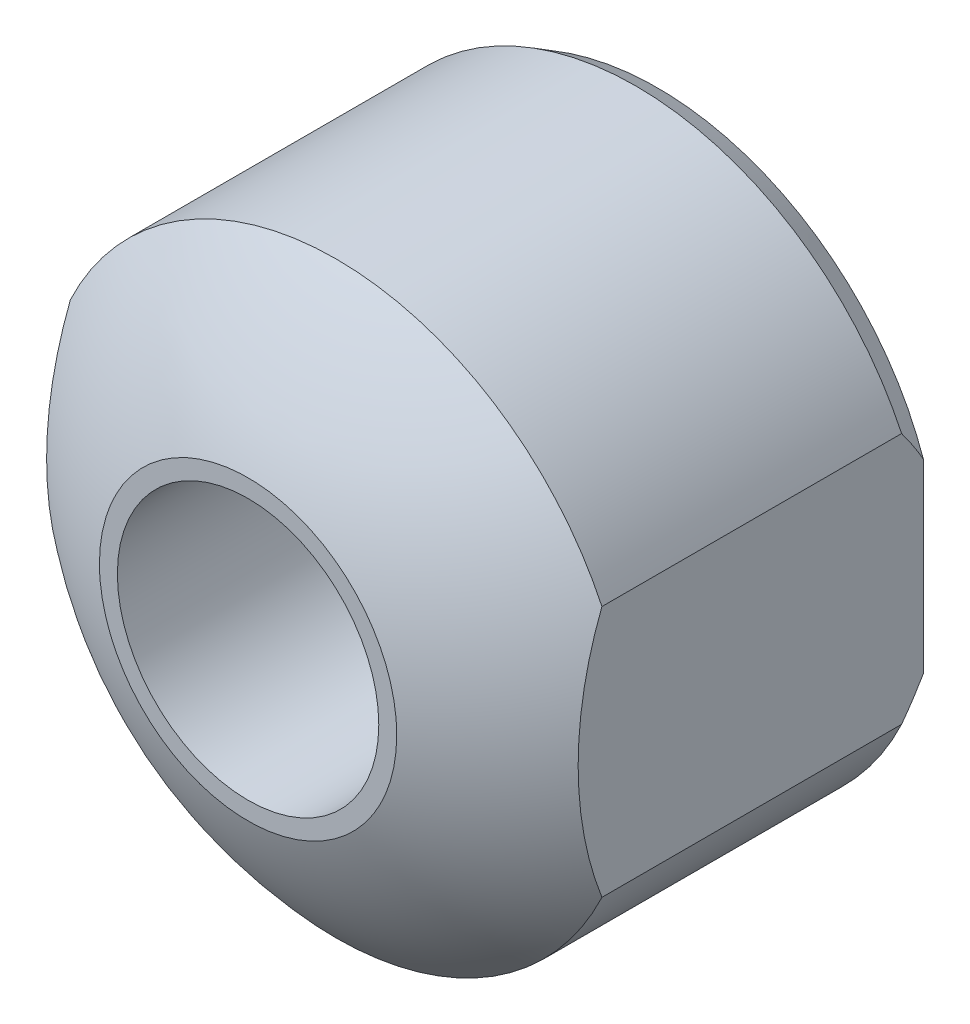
ISO-10303-21;
HEADER;
FILE_DESCRIPTION(('STEP AP214'),'2;1');
FILE_NAME('part.step','',(''),(''),'','','');
FILE_SCHEMA(('AUTOMOTIVE_DESIGN { 1 0 10303 214 1 1 1 1 }'));
ENDSEC;
DATA;
#1=APPLICATION_CONTEXT('core data for automotive mechanical design processes');
#2=APPLICATION_PROTOCOL_DEFINITION('international standard','automotive_design',2000,#1);
#3=PRODUCT_CONTEXT('',#1,'mechanical');
#4=PRODUCT('Part','Part','',(#3));
#5=PRODUCT_RELATED_PRODUCT_CATEGORY('part','',(#4));
#6=PRODUCT_DEFINITION_FORMATION('','',#4);
#7=PRODUCT_DEFINITION_CONTEXT('part definition',#1,'design');
#8=PRODUCT_DEFINITION('design','',#6,#7);
#9=PRODUCT_DEFINITION_SHAPE('','',#8);
#10=(LENGTH_UNIT() NAMED_UNIT(*) SI_UNIT(.MILLI.,.METRE.));
#11=(NAMED_UNIT(*) PLANE_ANGLE_UNIT() SI_UNIT($,.RADIAN.));
#12=(NAMED_UNIT(*) SI_UNIT($,.STERADIAN.) SOLID_ANGLE_UNIT());
#13=UNCERTAINTY_MEASURE_WITH_UNIT(LENGTH_MEASURE(1.E-05),#10,'distance_accuracy_value','');
#14=(GEOMETRIC_REPRESENTATION_CONTEXT(3) GLOBAL_UNCERTAINTY_ASSIGNED_CONTEXT((#13)) GLOBAL_UNIT_ASSIGNED_CONTEXT((#10,
#11,#12)) REPRESENTATION_CONTEXT('',''));
#15=CARTESIAN_POINT('',(0.,0.,0.));
#16=DIRECTION('',(0.,0.,1.));
#17=DIRECTION('',(1.,0.,0.));
#18=AXIS2_PLACEMENT_3D('',#15,#16,#17);
#19=CARTESIAN_POINT('',(0.,-3.91353616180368E-12,0.4999999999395));
#20=DIRECTION('',(0.,-7.82667624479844E-12,1.));
#21=DIRECTION('',(1.,0.,0.));
#22=AXIS2_PLACEMENT_3D('',#19,#20,#21);
#23=CONICAL_SURFACE('',#22,6.75000000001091,0.523598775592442);
#24=CARTESIAN_POINT('',(-6.09999999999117,2.13042695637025,-4.93771690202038E-11));
#25=CARTESIAN_POINT('',(-6.09999999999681,2.19631009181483,0.0376288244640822));
#26=CARTESIAN_POINT('',(-6.09999999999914,2.26151952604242,0.0764214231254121));
#27=CARTESIAN_POINT('',(-6.10000000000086,2.39058711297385,0.156070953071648));
#28=CARTESIAN_POINT('',(-6.10000000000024,2.4544464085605,0.196926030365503));
#29=CARTESIAN_POINT('',(-6.09999999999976,2.58092106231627,0.280501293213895));
#30=CARTESIAN_POINT('',(-6.09999999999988,2.6435365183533,0.323221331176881));
#31=CARTESIAN_POINT('',(-6.10000000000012,2.76764477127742,0.410378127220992));
#32=CARTESIAN_POINT('',(-6.10000000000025,2.82913652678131,0.454816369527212));
#33=CARTESIAN_POINT('',(-6.1,2.89006920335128,0.499999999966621));
#34=B_SPLINE_CURVE_WITH_KNOTS('',3,(#24,#25,#26,#27,#28,#29,#30,#31,#32,#33),.UNSPECIFIED.,.F.,
.F.,(4,2,2,2,4),(0.,0.227591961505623,0.454982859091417,0.682355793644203,0.909929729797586),.UNSPECIFIED.);
#35=CARTESIAN_POINT('',(-6.1,2.13042695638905,-4.19282664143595E-11));
#36=VERTEX_POINT('',#35);
#37=CARTESIAN_POINT('',(-6.1,2.89006920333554,0.499999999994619));
#38=VERTEX_POINT('',#37);
#39=EDGE_CURVE('E18',#36,#38,#34,.T.);
#40=ORIENTED_EDGE('',*,*,#39,.T.);
#41=CARTESIAN_POINT('',(0.,-3.91353616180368E-12,0.5));
#42=DIRECTION('',(0.,7.82667624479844E-12,-1.));
#43=DIRECTION('',(-1.,0.,0.));
#44=AXIS2_PLACEMENT_3D('',#41,#42,#43);
#45=CIRCLE('',#44,6.75);
#46=CARTESIAN_POINT('',(6.1,2.89006920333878,0.49999999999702));
#47=VERTEX_POINT('',#46);
#48=EDGE_CURVE('E103',#47,#38,#45,.F.);
#49=ORIENTED_EDGE('',*,*,#48,.F.);
#50=CARTESIAN_POINT('',(6.1,2.89006920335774,0.499999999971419));
#51=CARTESIAN_POINT('',(6.1,2.82913652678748,0.454816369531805));
#52=CARTESIAN_POINT('',(6.1,2.76764477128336,0.410378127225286));
#53=CARTESIAN_POINT('',(6.1,2.64353651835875,0.323221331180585));
#54=CARTESIAN_POINT('',(6.1,2.58092106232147,0.280501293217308));
#55=CARTESIAN_POINT('',(6.1,2.45444640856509,0.196926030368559));
#56=CARTESIAN_POINT('',(6.1,2.39058711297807,0.156070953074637));
#57=CARTESIAN_POINT('',(6.1,2.26151952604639,0.0764214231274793));
#58=CARTESIAN_POINT('',(6.1,2.19631009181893,0.037628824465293));
#59=CARTESIAN_POINT('',(6.1,2.130426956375,-4.99288110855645E-11));
#60=B_SPLINE_CURVE_WITH_KNOTS('',3,(#50,#51,#52,#53,#54,#55,#56,#57,#58,#59),.UNSPECIFIED.,.F.,
.F.,(4,2,2,2,4),(0.,0.227573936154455,0.454946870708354,0.682337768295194,0.909929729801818),.UNSPECIFIED.);
#61=CARTESIAN_POINT('',(6.1,2.1304269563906,-4.10262102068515E-11));
#62=VERTEX_POINT('',#61);
#63=EDGE_CURVE('E86',#47,#62,#60,.T.);
#64=ORIENTED_EDGE('',*,*,#63,.T.);
#65=CARTESIAN_POINT('',(0.,0.,-4.86520546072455E-11));
#66=DIRECTION('',(0.,-7.82667624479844E-12,1.));
#67=DIRECTION('',(1.,0.,0.));
#68=AXIS2_PLACEMENT_3D('',#65,#66,#67);
#69=CIRCLE('',#68,6.46132486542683);
#70=EDGE_CURVE('E84',#36,#62,#69,.F.);
#71=ORIENTED_EDGE('',*,*,#70,.F.);
#72=EDGE_LOOP('',(#40,#49,#64,#71));
#73=FACE_BOUND('',#72,.T.);
#74=ADVANCED_FACE('F14',(#73),#23,.T.);
#75=CARTESIAN_POINT('',(-3.23066243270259,0.,0.));
#76=DIRECTION('',(0.,7.82667624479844E-12,-1.));
#77=DIRECTION('',(-1.,0.,0.));
#78=AXIS2_PLACEMENT_3D('',#75,#76,#77);
#79=PLANE('',#78);
#80=CARTESIAN_POINT('',(0.,0.,6.50486609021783E-11));
#81=DIRECTION('',(0.,7.82667624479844E-12,-1.));
#82=DIRECTION('',(-1.,0.,0.));
#83=AXIS2_PLACEMENT_3D('',#80,#81,#82);
#84=CIRCLE('',#83,2.99999999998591);
#85=CARTESIAN_POINT('',(-2.99999999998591,0.,6.50486609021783E-11));
#86=VERTEX_POINT('',#85);
#87=EDGE_CURVE('E89',#86,#86,#84,.F.);
#88=ORIENTED_EDGE('',*,*,#87,.T.);
#89=EDGE_LOOP('',(#88));
#90=FACE_BOUND('',#89,.T.);
#91=DIRECTION('',(0.,1.,7.82667624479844E-12));
#92=VECTOR('',#91,1.);
#93=CARTESIAN_POINT('',(-6.1,6.75,5.28327381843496E-11));
#94=LINE('',#93,#92);
#95=CARTESIAN_POINT('',(-6.1,-2.13042695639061,-7.43745343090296E-11));
#96=VERTEX_POINT('',#95);
#97=EDGE_CURVE('E79',#96,#36,#94,.T.);
#98=ORIENTED_EDGE('',*,*,#97,.T.);
#99=ORIENTED_EDGE('',*,*,#70,.T.);
#100=DIRECTION('',(0.,-1.,-7.82667624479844E-12));
#101=VECTOR('',#100,1.);
#102=CARTESIAN_POINT('',(6.1,6.75,5.28327381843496E-11));
#103=LINE('',#102,#101);
#104=CARTESIAN_POINT('',(6.1,-2.130426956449,-4.10262102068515E-11));
#105=VERTEX_POINT('',#104);
#106=EDGE_CURVE('E108',#62,#105,#103,.T.);
#107=ORIENTED_EDGE('',*,*,#106,.T.);
#108=CARTESIAN_POINT('',(0.,0.,-4.86520546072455E-11));
#109=DIRECTION('',(0.,-7.82667624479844E-12,1.));
#110=DIRECTION('',(1.,0.,0.));
#111=AXIS2_PLACEMENT_3D('',#108,#109,#110);
#112=CIRCLE('',#111,6.46132486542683);
#113=EDGE_CURVE('E92',#96,#105,#112,.T.);
#114=ORIENTED_EDGE('',*,*,#113,.F.);
#115=EDGE_LOOP('',(#98,#99,#107,#114));
#116=FACE_BOUND('',#115,.T.);
#117=ADVANCED_FACE('F90',(#90,#116),#79,.T.);
#118=CARTESIAN_POINT('',(0.,-3.91353616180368E-12,0.4999999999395));
#119=DIRECTION('',(0.,-7.82667624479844E-12,1.));
#120=DIRECTION('',(1.,0.,0.));
#121=AXIS2_PLACEMENT_3D('',#118,#119,#120);
#122=CONICAL_SURFACE('',#121,6.75000000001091,0.523598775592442);
#123=CARTESIAN_POINT('',(-6.1,-2.89006920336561,0.499999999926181));
#124=CARTESIAN_POINT('',(-6.1,-2.82913652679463,0.454816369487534));
#125=CARTESIAN_POINT('',(-6.1,-2.76764477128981,0.410378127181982));
#126=CARTESIAN_POINT('',(-6.1,-2.64353651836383,0.323221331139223));
#127=CARTESIAN_POINT('',(-6.1,-2.58092106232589,0.280501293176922));
#128=CARTESIAN_POINT('',(-6.1,-2.45444640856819,0.196926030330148));
#129=CARTESIAN_POINT('',(-6.1,-2.39058711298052,0.156070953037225));
#130=CARTESIAN_POINT('',(-6.1,-2.2615195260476,0.076421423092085));
#131=CARTESIAN_POINT('',(-6.1,-2.19631009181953,0.0376288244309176));
#132=CARTESIAN_POINT('',(-6.1,-2.13042695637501,-8.32771351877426E-11));
#133=B_SPLINE_CURVE_WITH_KNOTS('',3,(#123,#124,#125,#126,#127,#128,#129,#130,#131,#132),
.UNSPECIFIED.,.F.,.F.,(4,2,2,2,4),(0.,0.227573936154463,0.454946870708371,0.68233776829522,
0.909929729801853),.UNSPECIFIED.);
#134=CARTESIAN_POINT('',(-6.1,-2.89006920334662,0.499999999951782));
#135=VERTEX_POINT('',#134);
#136=EDGE_CURVE('E95',#135,#96,#133,.T.);
#137=ORIENTED_EDGE('',*,*,#136,.T.);
#138=ORIENTED_EDGE('',*,*,#113,.T.);
#139=CARTESIAN_POINT('',(6.09999999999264,-2.1304269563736,-8.1375878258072E-11));
#140=CARTESIAN_POINT('',(6.09999999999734,-2.19631009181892,0.0376288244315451));
#141=CARTESIAN_POINT('',(6.09999999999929,-2.26151952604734,0.0764214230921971));
#142=CARTESIAN_POINT('',(6.10000000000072,-2.39058711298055,0.156070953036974));
#143=CARTESIAN_POINT('',(6.1000000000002,-2.45444640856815,0.196926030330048));
#144=CARTESIAN_POINT('',(6.0999999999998,-2.58092106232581,0.280501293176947));
#145=CARTESIAN_POINT('',(6.0999999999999,-2.64353651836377,0.323221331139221));
#146=CARTESIAN_POINT('',(6.1000000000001,-2.7676447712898,0.410378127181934));
#147=CARTESIAN_POINT('',(6.1000000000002,-2.82913652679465,0.454816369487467));
#148=CARTESIAN_POINT('',(6.1,-2.89006920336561,0.499999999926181));
#149=B_SPLINE_CURVE_WITH_KNOTS('',3,(#139,#140,#141,#142,#143,#144,#145,#146,#147,#148),
.UNSPECIFIED.,.F.,.F.,(4,2,2,2,4),(0.,0.227591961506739,0.454982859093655,0.682355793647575,
0.909929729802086),.UNSPECIFIED.);
#150=CARTESIAN_POINT('',(6.1,-2.89006920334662,0.499999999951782));
#151=VERTEX_POINT('',#150);
#152=EDGE_CURVE('E107',#105,#151,#149,.T.);
#153=ORIENTED_EDGE('',*,*,#152,.T.);
#154=CARTESIAN_POINT('',(0.,-3.91353616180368E-12,0.5));
#155=DIRECTION('',(0.,7.82667624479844E-12,-1.));
#156=DIRECTION('',(-1.,0.,0.));
#157=AXIS2_PLACEMENT_3D('',#154,#155,#156);
#158=CIRCLE('',#157,6.75);
#159=EDGE_CURVE('E110',#135,#151,#158,.F.);
#160=ORIENTED_EDGE('',*,*,#159,.F.);
#161=EDGE_LOOP('',(#137,#138,#153,#160));
#162=FACE_BOUND('',#161,.T.);
#163=ADVANCED_FACE('F147',(#162),#122,.T.);
#164=CARTESIAN_POINT('',(-1.7058722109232,-7.35730920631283E-11,9.4));
#165=DIRECTION('',(0.,-7.82667624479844E-12,1.));
#166=DIRECTION('',(1.,0.,0.));
#167=AXIS2_PLACEMENT_3D('',#164,#165,#166);
#168=PLANE('',#167);
#169=CARTESIAN_POINT('',(3.41174442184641,-7.35730920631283E-11,9.4));
#170=CARTESIAN_POINT('',(3.411753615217,-0.0959583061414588,9.39999999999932));
#171=CARTESIAN_POINT('',(3.40769608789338,-0.191912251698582,9.39999999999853));
#172=CARTESIAN_POINT('',(3.39151873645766,-0.38313365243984,9.39999999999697));
#173=CARTESIAN_POINT('',(3.37939929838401,-0.478401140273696,9.39999999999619));
#174=CARTESIAN_POINT('',(3.34718058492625,-0.667514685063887,9.39999999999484));
#175=CARTESIAN_POINT('',(3.32708692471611,-0.761361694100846,9.39999999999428));
#176=CARTESIAN_POINT('',(3.2790827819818,-0.947006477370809,9.39999999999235));
#177=CARTESIAN_POINT('',(3.25117239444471,-1.03880427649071,9.399999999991));
#178=CARTESIAN_POINT('',(3.15594259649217,-1.31023513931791,9.39999999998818));
#179=CARTESIAN_POINT('',(3.07711083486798,-1.48598574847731,9.39999999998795));
#180=CARTESIAN_POINT('',(2.89111439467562,-1.82162480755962,9.39999999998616));
#181=CARTESIAN_POINT('',(2.78395528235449,-1.98151636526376,9.3999999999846));
#182=CARTESIAN_POINT('',(2.54430388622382,-2.28107137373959,9.39999999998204));
#183=CARTESIAN_POINT('',(2.41181104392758,-2.42073437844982,9.39999999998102));
#184=CARTESIAN_POINT('',(2.12524080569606,-2.6758488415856,9.39999999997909));
#185=CARTESIAN_POINT('',(1.97116012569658,-2.79129660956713,9.39999999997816));
#186=CARTESIAN_POINT('',(1.6458090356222,-2.99468075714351,9.39999999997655));
#187=CARTESIAN_POINT('',(1.47453938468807,-3.08261835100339,9.39999999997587));
#188=CARTESIAN_POINT('',(1.11967881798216,-3.22848550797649,9.39999999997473));
#189=CARTESIAN_POINT('',(0.936088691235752,-3.28641699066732,9.39999999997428));
#190=CARTESIAN_POINT('',(0.561784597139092,-3.37063758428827,9.39999999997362));
#191=CARTESIAN_POINT('',(0.371070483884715,-3.39692604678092,9.39999999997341));
#192=CARTESIAN_POINT('',(-0.0120687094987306,-3.41711223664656,9.39999999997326));
#193=CARTESIAN_POINT('',(-0.204493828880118,-3.41100921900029,9.39999999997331));
#194=CARTESIAN_POINT('',(-0.585586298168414,-3.36658426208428,9.39999999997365));
#195=CARTESIAN_POINT('',(-0.774253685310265,-3.32826264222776,9.39999999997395));
#196=CARTESIAN_POINT('',(-1.14247634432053,-3.22048884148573,9.3999999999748));
#197=CARTESIAN_POINT('',(-1.32203164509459,-3.15103675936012,9.39999999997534));
#198=CARTESIAN_POINT('',(-1.66693827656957,-2.98297162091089,9.39999999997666));
#199=CARTESIAN_POINT('',(-1.83228923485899,-2.88435780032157,9.39999999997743));
#200=CARTESIAN_POINT('',(-2.1440801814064,-2.66077396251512,9.39999999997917));
#201=CARTESIAN_POINT('',(-2.29052110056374,-2.53580524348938,9.39999999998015));
#202=CARTESIAN_POINT('',(-2.56032639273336,-2.26307781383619,9.39999999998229));
#203=CARTESIAN_POINT('',(-2.68369386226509,-2.11532216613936,9.39999999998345));
#204=CARTESIAN_POINT('',(-2.90391130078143,-1.80113906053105,9.3999999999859));
#205=CARTESIAN_POINT('',(-3.00075282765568,-1.63470568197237,9.3999999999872));
#206=CARTESIAN_POINT('',(-3.16516464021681,-1.28787226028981,9.39999999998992));
#207=CARTESIAN_POINT('',(-3.23271710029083,-1.10746379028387,9.39999999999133));
#208=CARTESIAN_POINT('',(-3.3364714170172,-0.738007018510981,9.39999999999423));
#209=CARTESIAN_POINT('',(-3.37272115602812,-0.548972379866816,9.39999999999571));
#210=CARTESIAN_POINT('',(-3.39915729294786,-0.298901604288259,9.39999999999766));
#211=CARTESIAN_POINT('',(-3.40387996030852,-0.239166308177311,9.39999999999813));
#212=CARTESIAN_POINT('',(-3.41016921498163,-0.119628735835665,9.39999999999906));
#213=CARTESIAN_POINT('',(-3.41174100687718,-0.059826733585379,9.39999999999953));
#214=CARTESIAN_POINT('',(-3.41174442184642,-7.35730920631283E-11,9.4));
#215=B_SPLINE_CURVE_WITH_KNOTS('',3,(#169,#170,#171,#172,#173,#174,#175,#176,#177,#178,#179,
#180,#181,#182,#183,#184,#185,#186,#187,#188,#189,#190,#191,#192,#193,#194,#195,#196,#197,#198,
#199,#200,#201,#202,#203,#204,#205,#206,#207,#208,#209,#210,#211,#212,#213,#214),.UNSPECIFIED.,
.F.,.F.,(4,2,2,2,2,2,2,2,2,2,2,2,2,2,2,2,2,2,2,2,2,2,4),(0.,0.287781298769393,0.575548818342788,
0.863114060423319,1.15067580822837,1.7255586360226,2.30032858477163,2.87511120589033,
3.44998136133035,4.02482613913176,4.59963413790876,5.17445391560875,5.74928691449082,
6.32411421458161,6.8989396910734,7.47378023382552,8.04859246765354,8.62332750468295,
9.19824524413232,9.77351239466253,10.3478980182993,10.5276052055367,10.7070153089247),.UNSPECIFIED.);
#216=CARTESIAN_POINT('',(3.41174442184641,-7.35730920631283E-11,9.4));
#217=VERTEX_POINT('',#216);
#218=CARTESIAN_POINT('',(-3.41174442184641,-7.35730920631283E-11,9.4));
#219=VERTEX_POINT('',#218);
#220=EDGE_CURVE('E113',#217,#219,#215,.T.);
#221=ORIENTED_EDGE('',*,*,#220,.F.);
#222=CARTESIAN_POINT('',(-3.41174442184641,-7.35730920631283E-11,9.4));
#223=CARTESIAN_POINT('',(-3.41175361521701,0.0959583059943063,9.40000000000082));
#224=CARTESIAN_POINT('',(-3.40769608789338,0.191912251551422,9.40000000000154));
#225=CARTESIAN_POINT('',(-3.39151873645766,0.383133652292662,9.40000000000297));
#226=CARTESIAN_POINT('',(-3.37939929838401,0.478401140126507,9.40000000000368));
#227=CARTESIAN_POINT('',(-3.34718058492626,0.667514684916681,9.40000000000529));
#228=CARTESIAN_POINT('',(-3.32708692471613,0.761361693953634,9.40000000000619));
#229=CARTESIAN_POINT('',(-3.27908278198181,0.947006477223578,9.40000000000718));
#230=CARTESIAN_POINT('',(-3.25117239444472,1.03880427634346,9.40000000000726));
#231=CARTESIAN_POINT('',(-3.15594259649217,1.31023513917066,9.40000000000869));
#232=CARTESIAN_POINT('',(-3.07711083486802,1.48598574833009,9.40000000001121));
#233=CARTESIAN_POINT('',(-2.89111439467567,1.82162480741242,9.40000000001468));
#234=CARTESIAN_POINT('',(-2.78395528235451,1.98151636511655,9.40000000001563));
#235=CARTESIAN_POINT('',(-2.54430388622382,2.28107137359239,9.40000000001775));
#236=CARTESIAN_POINT('',(-2.4118110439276,2.42073437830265,9.40000000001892));
#237=CARTESIAN_POINT('',(-2.12524080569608,2.67584884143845,9.40000000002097));
#238=CARTESIAN_POINT('',(-1.97116012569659,2.79129660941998,9.40000000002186));
#239=CARTESIAN_POINT('',(-1.64580903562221,2.99468075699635,9.40000000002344));
#240=CARTESIAN_POINT('',(-1.47453938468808,3.08261835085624,9.40000000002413));
#241=CARTESIAN_POINT('',(-1.11967881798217,3.22848550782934,9.40000000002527));
#242=CARTESIAN_POINT('',(-0.936088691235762,3.28641699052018,9.40000000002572));
#243=CARTESIAN_POINT('',(-0.561784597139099,3.37063758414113,9.40000000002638));
#244=CARTESIAN_POINT('',(-0.371070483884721,3.39692604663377,9.40000000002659));
#245=CARTESIAN_POINT('',(0.012068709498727,3.41711223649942,9.40000000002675));
#246=CARTESIAN_POINT('',(0.204493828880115,3.41100921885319,9.40000000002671));
#247=CARTESIAN_POINT('',(0.585586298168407,3.36658426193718,9.40000000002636));
#248=CARTESIAN_POINT('',(0.774253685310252,3.32826264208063,9.40000000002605));
#249=CARTESIAN_POINT('',(1.14247634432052,3.22048884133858,9.40000000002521));
#250=CARTESIAN_POINT('',(1.32203164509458,3.15103675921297,9.40000000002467));
#251=CARTESIAN_POINT('',(1.66693827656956,2.98297162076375,9.40000000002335));
#252=CARTESIAN_POINT('',(1.83228923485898,2.88435780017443,9.40000000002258));
#253=CARTESIAN_POINT('',(2.14408018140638,2.66077396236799,9.40000000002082));
#254=CARTESIAN_POINT('',(2.29052110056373,2.53580524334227,9.40000000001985));
#255=CARTESIAN_POINT('',(2.56032639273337,2.26307781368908,9.40000000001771));
#256=CARTESIAN_POINT('',(2.6836938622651,2.11532216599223,9.40000000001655));
#257=CARTESIAN_POINT('',(2.90391130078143,1.80113906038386,9.4000000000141));
#258=CARTESIAN_POINT('',(3.00075282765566,1.63470568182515,9.4000000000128));
#259=CARTESIAN_POINT('',(3.16516464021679,1.28787226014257,9.40000000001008));
#260=CARTESIAN_POINT('',(3.23271710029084,1.10746379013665,9.40000000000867));
#261=CARTESIAN_POINT('',(3.33647141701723,0.738007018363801,9.40000000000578));
#262=CARTESIAN_POINT('',(3.37272115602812,0.548972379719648,9.40000000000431));
#263=CARTESIAN_POINT('',(3.39915729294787,0.298901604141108,9.40000000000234));
#264=CARTESIAN_POINT('',(3.40387996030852,0.239166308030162,9.40000000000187));
#265=CARTESIAN_POINT('',(3.41016921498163,0.119628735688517,9.40000000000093));
#266=CARTESIAN_POINT('',(3.41174100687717,0.0598267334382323,9.40000000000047));
#267=CARTESIAN_POINT('',(3.41174442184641,-7.35730920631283E-11,9.4));
#268=B_SPLINE_CURVE_WITH_KNOTS('',3,(#222,#223,#224,#225,#226,#227,#228,#229,#230,#231,#232,
#233,#234,#235,#236,#237,#238,#239,#240,#241,#242,#243,#244,#245,#246,#247,#248,#249,#250,#251,
#252,#253,#254,#255,#256,#257,#258,#259,#260,#261,#262,#263,#264,#265,#266,#267),.UNSPECIFIED.,
.F.,.F.,(4,2,2,2,2,2,2,2,2,2,2,2,2,2,2,2,2,2,2,2,2,2,4),(0.,0.287781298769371,0.575548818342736,
0.863114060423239,1.15067580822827,1.72555863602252,2.30032858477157,2.8751112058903,
3.44998136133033,4.02482613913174,4.59963413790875,5.17445391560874,5.74928691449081,
6.32411421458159,6.8989396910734,7.4737802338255,8.0485924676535,8.62332750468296,
9.1982452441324,9.77351239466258,10.3478980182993,10.5276052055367,10.7070153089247),.UNSPECIFIED.);
#269=EDGE_CURVE('E123',#219,#217,#268,.T.);
#270=ORIENTED_EDGE('',*,*,#269,.F.);
#271=EDGE_LOOP('',(#221,#270));
#272=FACE_BOUND('',#271,.T.);
#273=CARTESIAN_POINT('',(0.,-7.35730920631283E-11,9.39999999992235));
#274=DIRECTION('',(0.,-7.82667624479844E-12,1.));
#275=DIRECTION('',(1.,0.,0.));
#276=AXIS2_PLACEMENT_3D('',#273,#274,#275);
#277=CIRCLE('',#276,3.00000000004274);
#278=CARTESIAN_POINT('',(3.00000000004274,-7.35730920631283E-11,9.39999999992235));
#279=VERTEX_POINT('',#278);
#280=EDGE_CURVE('E192',#279,#279,#277,.F.);
#281=ORIENTED_EDGE('',*,*,#280,.T.);
#282=EDGE_LOOP('',(#281));
#283=FACE_BOUND('',#282,.T.);
#284=ADVANCED_FACE('F141',(#272,#283),#168,.T.);
#285=CARTESIAN_POINT('',(6.1,6.75,5.28327381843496E-11));
#286=DIRECTION('',(-1.,0.,0.));
#287=DIRECTION('',(0.,-1.,-7.82667624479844E-12));
#288=AXIS2_PLACEMENT_3D('',#285,#286,#287);
#289=PLANE('',#288);
#290=ORIENTED_EDGE('',*,*,#106,.F.);
#291=ORIENTED_EDGE('',*,*,#63,.F.);
#292=DIRECTION('',(0.,7.82667624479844E-12,-1.));
#293=VECTOR('',#292,1.);
#294=CARTESIAN_POINT('',(6.1,2.89006920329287,3.93908864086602));
#295=LINE('',#294,#293);
#296=CARTESIAN_POINT('',(6.1,2.8900692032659,7.37817728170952));
#297=VERTEX_POINT('',#296);
#298=EDGE_CURVE('E104',#297,#47,#295,.T.);
#299=ORIENTED_EDGE('',*,*,#298,.F.);
#300=CARTESIAN_POINT('',(6.1,0.,0.));
#301=DIRECTION('',(-1.,0.,0.));
#302=DIRECTION('',(0.,-1.,-7.82667624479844E-12));
#303=AXIS2_PLACEMENT_3D('',#300,#301,#302);
#304=CIRCLE('',#303,7.92401413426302);
#305=CARTESIAN_POINT('',(6.1,-2.89006920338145,7.37817728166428));
#306=VERTEX_POINT('',#305);
#307=EDGE_CURVE('E120',#306,#297,#304,.T.);
#308=ORIENTED_EDGE('',*,*,#307,.F.);
#309=DIRECTION('',(0.,7.82667624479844E-12,-1.));
#310=VECTOR('',#309,1.);
#311=CARTESIAN_POINT('',(6.1,-2.89006920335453,3.93908864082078));
#312=LINE('',#311,#310);
#313=EDGE_CURVE('E94',#151,#306,#312,.F.);
#314=ORIENTED_EDGE('',*,*,#313,.F.);
#315=ORIENTED_EDGE('',*,*,#152,.F.);
#316=EDGE_LOOP('',(#290,#291,#299,#308,#314,#315));
#317=FACE_BOUND('',#316,.T.);
#318=ADVANCED_FACE('F146',(#317),#289,.F.);
#319=CARTESIAN_POINT('',(0.,-3.08295056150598E-11,3.9390886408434));
#320=DIRECTION('',(0.,7.82667624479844E-12,-1.));
#321=DIRECTION('',(-1.,0.,0.));
#322=AXIS2_PLACEMENT_3D('',#319,#320,#321);
#323=CYLINDRICAL_SURFACE('',#322,6.75);
#324=DIRECTION('',(0.,-7.82667624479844E-12,1.));
#325=VECTOR('',#324,1.);
#326=CARTESIAN_POINT('',(-6.1,2.89006920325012,9.40000000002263));
#327=LINE('',#326,#325);
#328=CARTESIAN_POINT('',(-6.1,2.8900692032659,7.37817728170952));
#329=VERTEX_POINT('',#328);
#330=EDGE_CURVE('E80',#38,#329,#327,.T.);
#331=ORIENTED_EDGE('',*,*,#330,.T.);
#332=CARTESIAN_POINT('',(0.,-5.77524139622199E-11,7.3781772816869));
#333=DIRECTION('',(0.,7.82667624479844E-12,-1.));
#334=DIRECTION('',(-1.,0.,0.));
#335=AXIS2_PLACEMENT_3D('',#332,#333,#334);
#336=CIRCLE('',#335,6.75);
#337=EDGE_CURVE('E117',#297,#329,#336,.F.);
#338=ORIENTED_EDGE('',*,*,#337,.F.);
#339=ORIENTED_EDGE('',*,*,#298,.T.);
#340=ORIENTED_EDGE('',*,*,#48,.T.);
#341=EDGE_LOOP('',(#331,#338,#339,#340));
#342=FACE_BOUND('',#341,.T.);
#343=ADVANCED_FACE('F169',(#342),#323,.T.);
#344=CARTESIAN_POINT('',(-6.1,6.74999999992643,9.40000000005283));
#345=DIRECTION('',(1.,0.,0.));
#346=DIRECTION('',(0.,1.,7.82667624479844E-12));
#347=AXIS2_PLACEMENT_3D('',#344,#345,#346);
#348=PLANE('',#347);
#349=ORIENTED_EDGE('',*,*,#97,.F.);
#350=ORIENTED_EDGE('',*,*,#136,.F.);
#351=DIRECTION('',(0.,7.82667624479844E-12,-1.));
#352=VECTOR('',#351,1.);
#353=CARTESIAN_POINT('',(-6.1,-2.89006920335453,3.93908864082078));
#354=LINE('',#353,#352);
#355=CARTESIAN_POINT('',(-6.1,-2.89006920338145,7.37817728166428));
#356=VERTEX_POINT('',#355);
#357=EDGE_CURVE('E38',#356,#135,#354,.T.);
#358=ORIENTED_EDGE('',*,*,#357,.F.);
#359=CARTESIAN_POINT('',(-6.1,0.,0.));
#360=DIRECTION('',(-1.,0.,0.));
#361=DIRECTION('',(0.,-1.,-7.82667624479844E-12));
#362=AXIS2_PLACEMENT_3D('',#359,#360,#361);
#363=CIRCLE('',#362,7.92401413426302);
#364=EDGE_CURVE('E29',#329,#356,#363,.F.);
#365=ORIENTED_EDGE('',*,*,#364,.F.);
#366=ORIENTED_EDGE('',*,*,#330,.F.);
#367=ORIENTED_EDGE('',*,*,#39,.F.);
#368=EDGE_LOOP('',(#349,#350,#358,#365,#366,#367));
#369=FACE_BOUND('',#368,.T.);
#370=ADVANCED_FACE('F77',(#369),#348,.F.);
#371=CARTESIAN_POINT('',(0.,-3.08295056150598E-11,3.9390886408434));
#372=DIRECTION('',(0.,7.82667624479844E-12,-1.));
#373=DIRECTION('',(-1.,0.,0.));
#374=AXIS2_PLACEMENT_3D('',#371,#372,#373);
#375=CYLINDRICAL_SURFACE('',#374,6.75);
#376=ORIENTED_EDGE('',*,*,#357,.T.);
#377=ORIENTED_EDGE('',*,*,#159,.T.);
#378=ORIENTED_EDGE('',*,*,#313,.T.);
#379=CARTESIAN_POINT('',(0.,-5.77524139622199E-11,7.3781772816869));
#380=DIRECTION('',(0.,7.82667624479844E-12,-1.));
#381=DIRECTION('',(-1.,0.,0.));
#382=AXIS2_PLACEMENT_3D('',#379,#380,#381);
#383=CIRCLE('',#382,6.75);
#384=EDGE_CURVE('E9',#356,#306,#383,.F.);
#385=ORIENTED_EDGE('',*,*,#384,.F.);
#386=EDGE_LOOP('',(#376,#377,#378,#385));
#387=FACE_BOUND('',#386,.T.);
#388=ADVANCED_FACE('F168',(#387),#375,.T.);
#389=CARTESIAN_POINT('',(0.,0.,0.));
#390=DIRECTION('',(-1.,0.,0.));
#391=DIRECTION('',(0.,-7.82667624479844E-12,1.));
#392=AXIS2_PLACEMENT_3D('',#389,#390,#391);
#393=SPHERICAL_SURFACE('',#392,10.);
#394=ORIENTED_EDGE('',*,*,#364,.T.);
#395=ORIENTED_EDGE('',*,*,#384,.T.);
#396=ORIENTED_EDGE('',*,*,#307,.T.);
#397=ORIENTED_EDGE('',*,*,#337,.T.);
#398=EDGE_LOOP('',(#394,#395,#396,#397));
#399=FACE_BOUND('',#398,.T.);
#400=ORIENTED_EDGE('',*,*,#220,.T.);
#401=ORIENTED_EDGE('',*,*,#269,.T.);
#402=EDGE_LOOP('',(#400,#401));
#403=FACE_BOUND('',#402,.T.);
#404=ADVANCED_FACE('F136',(#399,#403),#393,.T.);
#405=CARTESIAN_POINT('',(0.,0.,10.));
#406=DIRECTION('',(0.,0.,-1.));
#407=DIRECTION('',(0.,1.,0.));
#408=AXIS2_PLACEMENT_3D('',#405,#406,#407);
#409=CYLINDRICAL_SURFACE('',#408,3.);
#410=ORIENTED_EDGE('',*,*,#280,.F.);
#411=EDGE_LOOP('',(#410));
#412=FACE_BOUND('',#411,.T.);
#413=ORIENTED_EDGE('',*,*,#87,.F.);
#414=EDGE_LOOP('',(#413));
#415=FACE_BOUND('',#414,.T.);
#416=ADVANCED_FACE('F179',(#412,#415),#409,.F.);
#417=CLOSED_SHELL('',(#74,#117,#163,#284,#318,#343,#370,#388,#404,#416));
#418=MANIFOLD_SOLID_BREP('B1',#417);
#419=ADVANCED_BREP_SHAPE_REPRESENTATION('',(#18,#418),#14);
#420=SHAPE_DEFINITION_REPRESENTATION(#9,#419);
ENDSEC;
END-ISO-10303-21;
